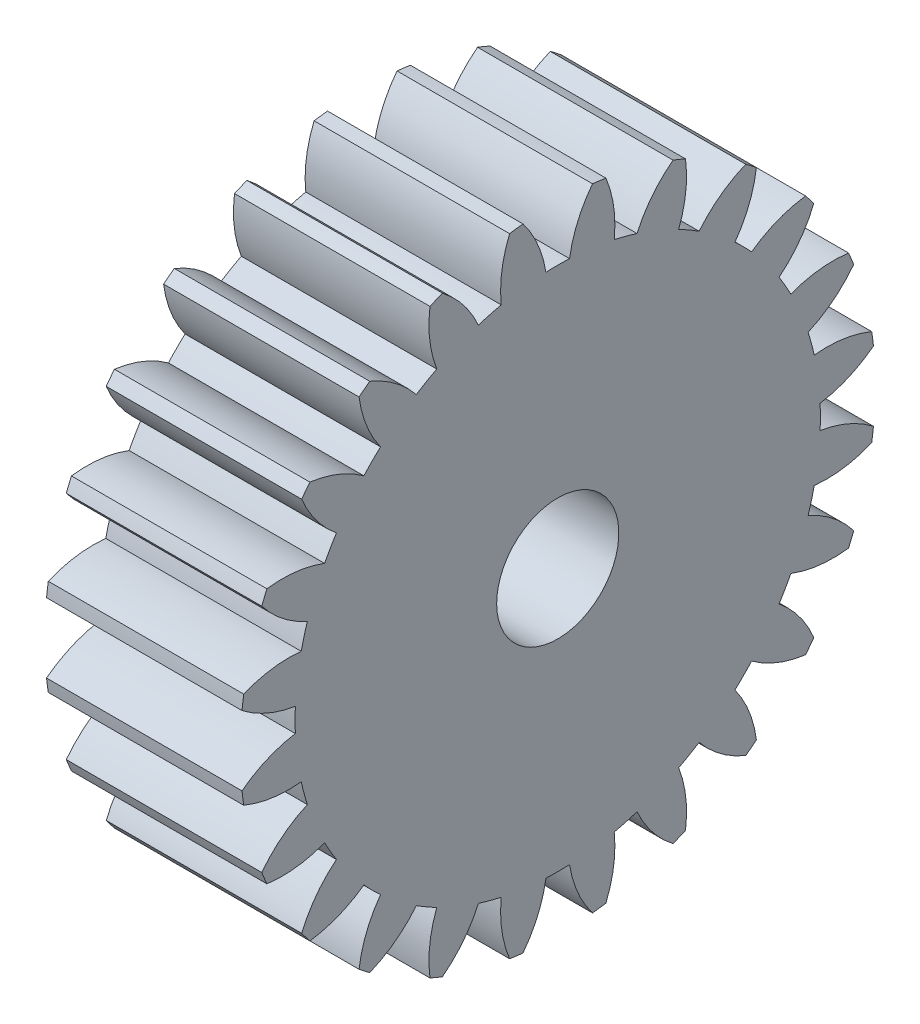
from build123d import *

# Parameters (mm, degrees)
BASPROSKE_W     = 8
BASPROSKE_H     = 13
TOOTHCUT_DEPTH  = 21.049937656
TEETHCUTS_COUNT = 24
TEETHCUTS_ANGLE = 345
BORSKE_R        = 2.5
BORE_DEPTH      = 50.0000508


with BuildPart() as part:
    # BasProSke → Base-Revolve (revolve)
    with BuildSketch(Plane(origin=(0, 0, 0), x_dir=(1, 0, 0), z_dir=(0, 1, 0)), mode=Mode.PRIVATE) as base_revolve_sk:
        with Locations((4, 6.5)):
            Rectangle(BASPROSKE_W, BASPROSKE_H)
    revolve(base_revolve_sk.sketch.rotate(Axis((-10, 0, 0), (1, 0, 0)), 180), axis=Axis((-10, 0, 0), (1, 0, 0)))

    # TooCutSke → ToothCut (cut, through all)
    with BuildSketch(Plane(origin=(0, 0, 0), x_dir=(0, 0, -1), z_dir=(1, 0, 0))):
        with BuildLine():
            ThreePointArc((0.483448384, 10.738122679), (0, 10.749), (-0.483448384, 10.738122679))
            ThreePointArc((-0.483448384, 10.738122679), (-0.821636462, 11.902754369), (-1.44092227, 12.945454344))
            ThreePointArc((-1.44092227, 12.945454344), (0, 13.0254), (1.44092227, 12.945454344))
            ThreePointArc((1.44092227, 12.945454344), (0.821636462, 11.902754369), (0.483448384, 10.738122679))
        make_face()
    toothcut = extrude(amount=TOOTHCUT_DEPTH, mode=Mode.SUBTRACT)

    # TeethCuts: ToothCut ×24 about axis
    teethcuts_axis = Axis((-10, 0, 0), (1, 0, 0))
    for i in range(1, TEETHCUTS_COUNT):
        add(toothcut.rotate(teethcuts_axis, i * TEETHCUTS_ANGLE / (TEETHCUTS_COUNT - 1)), mode=Mode.SUBTRACT)

    # BorSke → Bore (cut, symmetric)
    with BuildSketch(Plane(origin=(0, 0, 0), x_dir=(0, 0, -1), z_dir=(1, 0, 0))):
        with Locations(Location((0, 0, 0), (0, 0, 180))):
            Circle(BORSKE_R)
    extrude(amount=BORE_DEPTH, both=True, mode=Mode.SUBTRACT)


solid = part.part
